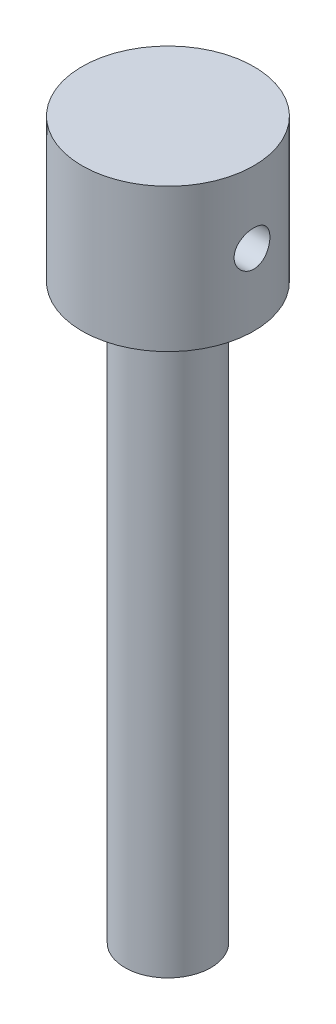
from build123d import *

# Parameters (mm, degrees)
SKETCH2_R           = 12
BOSS_EXTRUDE1_DEPTH = 20
SKETCH3_R           = 6
BOSS_EXTRUDE2_DEPTH = 80
SKETCH4_R           = 2.5
CUT_EXTRUDE1_DEPTH  = 80


with BuildPart() as part:
    # Sketch2 → Boss-Extrude1 (new body)
    with BuildSketch(Plane(origin=(0, 0, 0), x_dir=(1, 0, 0), z_dir=(0, 1, 0))):
        with Locations(Location((0, 0, 0), (0, 0, 270))):
            Circle(SKETCH2_R)
    extrude(amount=-BOSS_EXTRUDE1_DEPTH)

    # Sketch3 → Boss-Extrude2 (add)
    with BuildSketch(Plane.XZ.offset(20)):
        with Locations(Location((0, 0, 0), (0, 0, 270))):
            Circle(SKETCH3_R)
    extrude(amount=BOSS_EXTRUDE2_DEPTH)

    # Sketch4 → Cut-Extrude1 (cut)
    with BuildSketch(Plane(origin=(12, 0, 0), x_dir=(0, 0, -1), z_dir=(1, 0, 0))):
        with Locations((0, -10)):
            Circle(SKETCH4_R)
    extrude(amount=-CUT_EXTRUDE1_DEPTH, mode=Mode.SUBTRACT)


solid = part.part
